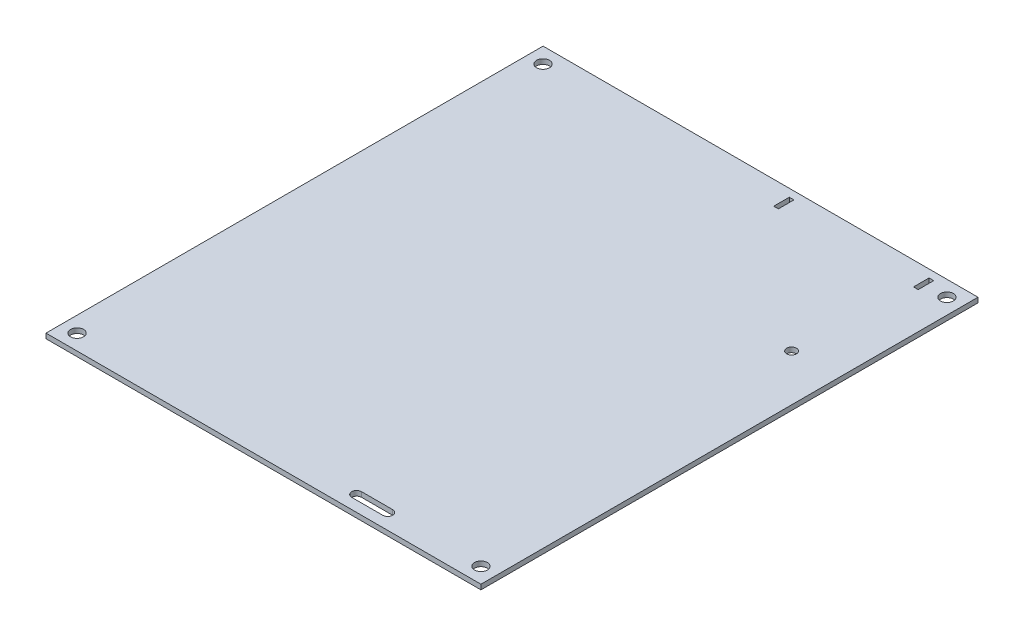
from build123d import *

# Parameters (mm, degrees)
SKETCH1_R           = 3.175
SKETCH1_R_2         = 4.175
SKETCH1_W           = 2.9972
SKETCH1_H           = 10
BOSS_EXTRUDE1_DEPTH = 3.175


with BuildPart() as part:
    # Sketch1 → Boss-Extrude1 (new body)
    with BuildSketch(Plane(origin=(0, 0, 0), x_dir=(1, 0, 0), z_dir=(0, 1, 0))):
        Polygon((0, 0), (140, 0), (280, 0), (280, 320), (0, 320), (0, 160), align=None)
        with Locations(Location((250, 230, 0), (0, 0, 270))):
            Circle(SKETCH1_R, mode=Mode.SUBTRACT)
        with Locations(Location((10, 310, 0), (0, 0, 270))):
            Circle(SKETCH1_R_2, mode=Mode.SUBTRACT)
        with Locations(Location((10, 10, 0), (0, 0, 270))):
            Circle(SKETCH1_R_2, mode=Mode.SUBTRACT)
        with Locations(Location((270, 10, 0), (0, 0, 270))):
            Circle(SKETCH1_R_2, mode=Mode.SUBTRACT)
        with Locations(Location((270, 310, 0), (0, 0, 270))):
            Circle(SKETCH1_R_2, mode=Mode.SUBTRACT)
        with BuildLine():
            Line((190, 13.175), (210, 13.175))
            ThreePointArc((210, 13.175), (213.175, 10), (210, 6.825))
            Line((210, 6.825), (190, 6.825))
            ThreePointArc((190, 6.825), (186.825, 10), (190, 13.175))
        make_face(mode=Mode.SUBTRACT)
        with Locations((165, 310)):
            Rectangle(SKETCH1_W, SKETCH1_H, mode=Mode.SUBTRACT)
        with Locations((255, 310)):
            Rectangle(SKETCH1_W, SKETCH1_H, mode=Mode.SUBTRACT)
    extrude(amount=BOSS_EXTRUDE1_DEPTH)


solid = part.part
